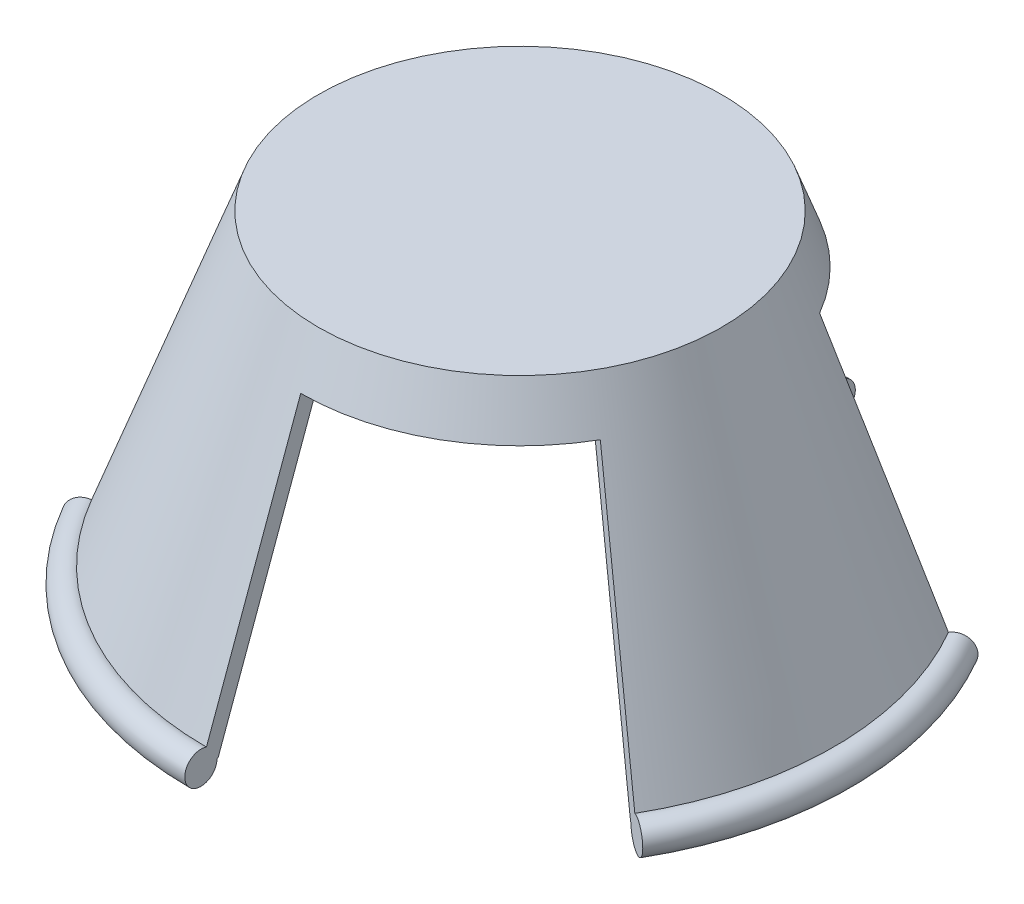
ISO-10303-21;
HEADER;
FILE_DESCRIPTION(('STEP AP214'),'2;1');
FILE_NAME('part.step','',(''),(''),'','','');
FILE_SCHEMA(('AUTOMOTIVE_DESIGN { 1 0 10303 214 1 1 1 1 }'));
ENDSEC;
DATA;
#1=APPLICATION_CONTEXT('core data for automotive mechanical design processes');
#2=APPLICATION_PROTOCOL_DEFINITION('international standard','automotive_design',2000,#1);
#3=PRODUCT_CONTEXT('',#1,'mechanical');
#4=PRODUCT('Part','Part','',(#3));
#5=PRODUCT_RELATED_PRODUCT_CATEGORY('part','',(#4));
#6=PRODUCT_DEFINITION_FORMATION('','',#4);
#7=PRODUCT_DEFINITION_CONTEXT('part definition',#1,'design');
#8=PRODUCT_DEFINITION('design','',#6,#7);
#9=PRODUCT_DEFINITION_SHAPE('','',#8);
#10=(LENGTH_UNIT() NAMED_UNIT(*) SI_UNIT(.MILLI.,.METRE.));
#11=(NAMED_UNIT(*) PLANE_ANGLE_UNIT() SI_UNIT($,.RADIAN.));
#12=(NAMED_UNIT(*) SI_UNIT($,.STERADIAN.) SOLID_ANGLE_UNIT());
#13=UNCERTAINTY_MEASURE_WITH_UNIT(LENGTH_MEASURE(1.E-05),#10,'distance_accuracy_value','');
#14=(GEOMETRIC_REPRESENTATION_CONTEXT(3) GLOBAL_UNCERTAINTY_ASSIGNED_CONTEXT((#13)) GLOBAL_UNIT_ASSIGNED_CONTEXT((#10,
#11,#12)) REPRESENTATION_CONTEXT('',''));
#15=CARTESIAN_POINT('',(0.,0.,0.));
#16=DIRECTION('',(0.,0.,1.));
#17=DIRECTION('',(1.,0.,0.));
#18=AXIS2_PLACEMENT_3D('',#15,#16,#17);
#19=CARTESIAN_POINT('',(0.,0.,0.));
#20=DIRECTION('',(0.,1.,0.));
#21=DIRECTION('',(0.,0.,1.));
#22=AXIS2_PLACEMENT_3D('',#19,#20,#21);
#23=TOROIDAL_SURFACE('',#22,19.7794046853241,1.);
#24=CARTESIAN_POINT('',(0.,0.,0.));
#25=DIRECTION('',(0.,1.,0.));
#26=DIRECTION('',(0.,0.,1.));
#27=AXIS2_PLACEMENT_3D('',#24,#25,#26);
#28=CIRCLE('',#27,18.7794046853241);
#29=CARTESIAN_POINT('',(0.,0.,-18.7794046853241));
#30=VERTEX_POINT('',#29);
#31=CARTESIAN_POINT('',(-16.2634415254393,0.,-9.38970234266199));
#32=VERTEX_POINT('',#31);
#33=EDGE_CURVE('E235',#30,#32,#28,.T.);
#34=ORIENTED_EDGE('',*,*,#33,.T.);
#35=CARTESIAN_POINT('',(-17.1294669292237,0.,-9.88970234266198));
#36=DIRECTION('',(0.499999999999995,0.,-0.866025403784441));
#37=DIRECTION('',(-0.866025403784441,0.,-0.499999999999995));
#38=AXIS2_PLACEMENT_3D('',#35,#36,#37);
#39=CIRCLE('',#38,1.);
#40=CARTESIAN_POINT('',(-16.8332687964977,0.939692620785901,-9.71869227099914));
#41=VERTEX_POINT('',#40);
#42=EDGE_CURVE('E189',#41,#32,#39,.F.);
#43=ORIENTED_EDGE('',*,*,#42,.F.);
#44=CARTESIAN_POINT('',(0.,0.939692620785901,0.));
#45=DIRECTION('',(0.,1.,0.));
#46=DIRECTION('',(0.,0.,1.));
#47=AXIS2_PLACEMENT_3D('',#44,#45,#46);
#48=CIRCLE('',#47,19.4373845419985);
#49=CARTESIAN_POINT('',(0.,0.939692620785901,-19.4373845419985));
#50=VERTEX_POINT('',#49);
#51=EDGE_CURVE('E240',#50,#41,#48,.T.);
#52=ORIENTED_EDGE('',*,*,#51,.F.);
#53=CARTESIAN_POINT('',(0.,0.,-19.7794046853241));
#54=DIRECTION('',(-1.,0.,0.));
#55=DIRECTION('',(0.,0.,1.));
#56=AXIS2_PLACEMENT_3D('',#53,#54,#55);
#57=CIRCLE('',#56,1.);
#58=EDGE_CURVE('E220',#30,#50,#57,.F.);
#59=ORIENTED_EDGE('',*,*,#58,.F.);
#60=EDGE_LOOP('',(#34,#43,#52,#59));
#61=FACE_BOUND('',#60,.T.);
#62=ADVANCED_FACE('F41',(#61),#23,.T.);
#63=CARTESIAN_POINT('',(-17.1294669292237,0.,9.88970234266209));
#64=DIRECTION('',(0.500000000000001,0.,0.866025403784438));
#65=DIRECTION('',(0.866025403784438,0.,-0.500000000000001));
#66=AXIS2_PLACEMENT_3D('',#63,#64,#65);
#67=CIRCLE('',#66,1.);
#68=CARTESIAN_POINT('',(-16.2634415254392,0.,9.38970234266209));
#69=VERTEX_POINT('',#68);
#70=CARTESIAN_POINT('',(-16.8332687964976,0.939692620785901,9.71869227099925));
#71=VERTEX_POINT('',#70);
#72=EDGE_CURVE('E196',#69,#71,#67,.F.);
#73=ORIENTED_EDGE('',*,*,#72,.F.);
#74=CARTESIAN_POINT('',(1.87643947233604E-13,0.,18.7794046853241));
#75=VERTEX_POINT('',#74);
#76=EDGE_CURVE('E239',#69,#75,#28,.T.);
#77=ORIENTED_EDGE('',*,*,#76,.T.);
#78=CARTESIAN_POINT('',(1.9763595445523E-13,0.,19.7794046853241));
#79=DIRECTION('',(-1.,0.,0.));
#80=DIRECTION('',(0.,0.,1.));
#81=AXIS2_PLACEMENT_3D('',#78,#79,#80);
#82=CIRCLE('',#81,1.);
#83=CARTESIAN_POINT('',(1.94218486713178E-13,0.939692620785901,19.4373845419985));
#84=VERTEX_POINT('',#83);
#85=EDGE_CURVE('E173',#84,#75,#82,.F.);
#86=ORIENTED_EDGE('',*,*,#85,.F.);
#87=EDGE_CURVE('E171',#71,#84,#48,.T.);
#88=ORIENTED_EDGE('',*,*,#87,.F.);
#89=EDGE_LOOP('',(#73,#77,#86,#88));
#90=FACE_BOUND('',#89,.T.);
#91=ADVANCED_FACE('F286',(#90),#23,.T.);
#92=CARTESIAN_POINT('',(0.,0.,0.));
#93=DIRECTION('',(0.,-1.,0.));
#94=DIRECTION('',(0.,0.,-1.));
#95=AXIS2_PLACEMENT_3D('',#92,#93,#94);
#96=PLANE('',#95);
#97=DIRECTION('',(-0.866025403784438,0.,0.500000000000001));
#98=VECTOR('',#97,1.);
#99=CARTESIAN_POINT('',(0.,0.,0.));
#100=LINE('',#99,#98);
#101=CARTESIAN_POINT('',(-16.2078619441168,0.,9.35761345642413));
#102=VERTEX_POINT('',#101);
#103=EDGE_CURVE('E193',#102,#69,#100,.T.);
#104=ORIENTED_EDGE('',*,*,#103,.F.);
#105=CARTESIAN_POINT('',(0.,0.,0.));
#106=DIRECTION('',(0.,-1.,0.));
#107=DIRECTION('',(0.,0.,-1.));
#108=AXIS2_PLACEMENT_3D('',#105,#106,#107);
#109=CIRCLE('',#108,18.7152269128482);
#110=CARTESIAN_POINT('',(1.87002682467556E-13,0.,18.7152269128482));
#111=VERTEX_POINT('',#110);
#112=EDGE_CURVE('E234',#102,#111,#109,.F.);
#113=ORIENTED_EDGE('',*,*,#112,.T.);
#114=DIRECTION('',(0.,0.,-1.));
#115=VECTOR('',#114,1.);
#116=CARTESIAN_POINT('',(0.,0.,0.));
#117=LINE('',#116,#115);
#118=EDGE_CURVE('E155',#75,#111,#117,.T.);
#119=ORIENTED_EDGE('',*,*,#118,.F.);
#120=ORIENTED_EDGE('',*,*,#76,.F.);
#121=EDGE_LOOP('',(#104,#113,#119,#120));
#122=FACE_BOUND('',#121,.T.);
#123=ADVANCED_FACE('F290',(#122),#96,.T.);
#124=DIRECTION('',(0.866025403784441,0.,0.499999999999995));
#125=VECTOR('',#124,1.);
#126=CARTESIAN_POINT('',(0.,0.,0.));
#127=LINE('',#126,#125);
#128=CARTESIAN_POINT('',(16.2078619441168,0.,9.35761345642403));
#129=VERTEX_POINT('',#128);
#130=CARTESIAN_POINT('',(16.2634415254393,0.,9.38970234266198));
#131=VERTEX_POINT('',#130);
#132=EDGE_CURVE('E172',#129,#131,#127,.T.);
#133=ORIENTED_EDGE('',*,*,#132,.F.);
#134=CARTESIAN_POINT('',(16.2078619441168,0.,-9.35761345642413));
#135=VERTEX_POINT('',#134);
#136=EDGE_CURVE('E224',#129,#135,#109,.F.);
#137=ORIENTED_EDGE('',*,*,#136,.T.);
#138=DIRECTION('',(-0.866025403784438,0.,0.500000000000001));
#139=VECTOR('',#138,1.);
#140=CARTESIAN_POINT('',(0.,0.,0.));
#141=LINE('',#140,#139);
#142=CARTESIAN_POINT('',(16.2634415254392,0.,-9.38970234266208));
#143=VERTEX_POINT('',#142);
#144=EDGE_CURVE('E208',#143,#135,#141,.T.);
#145=ORIENTED_EDGE('',*,*,#144,.F.);
#146=EDGE_CURVE('E228',#131,#143,#28,.T.);
#147=ORIENTED_EDGE('',*,*,#146,.F.);
#148=EDGE_LOOP('',(#133,#137,#145,#147));
#149=FACE_BOUND('',#148,.T.);
#150=ADVANCED_FACE('F304',(#149),#96,.T.);
#151=CARTESIAN_POINT('',(0.,19.6579798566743,0.));
#152=DIRECTION('',(0.,-1.,0.));
#153=DIRECTION('',(0.,0.,-1.));
#154=AXIS2_PLACEMENT_3D('',#151,#152,#153);
#155=CONICAL_SURFACE('',#154,11.5603073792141,0.34906585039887);
#156=ORIENTED_EDGE('',*,*,#112,.F.);
#157=DIRECTION('',(-0.296198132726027,-0.939692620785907,0.171010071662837));
#158=VECTOR('',#157,1.);
#159=CARTESIAN_POINT('',(0.,51.4196633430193,0.));
#160=LINE('',#159,#158);
#161=CARTESIAN_POINT('',(-10.8493349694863,17.,6.26386646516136));
#162=VERTEX_POINT('',#161);
#163=EDGE_CURVE('E11',#102,#162,#160,.F.);
#164=ORIENTED_EDGE('',*,*,#163,.T.);
#165=CARTESIAN_POINT('',(0.,17.,0.));
#166=DIRECTION('',(0.,1.,0.));
#167=DIRECTION('',(0.,0.,1.));
#168=AXIS2_PLACEMENT_3D('',#165,#166,#167);
#169=CIRCLE('',#168,12.5277329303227);
#170=CARTESIAN_POINT('',(1.25177197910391E-13,17.,12.5277329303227));
#171=VERTEX_POINT('',#170);
#172=EDGE_CURVE('E229',#162,#171,#169,.T.);
#173=ORIENTED_EDGE('',*,*,#172,.T.);
#174=DIRECTION('',(0.,0.939692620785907,-0.342020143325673));
#175=VECTOR('',#174,1.);
#176=CARTESIAN_POINT('',(0.,51.4196633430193,0.));
#177=LINE('',#176,#175);
#178=EDGE_CURVE('E162',#171,#111,#177,.F.);
#179=ORIENTED_EDGE('',*,*,#178,.T.);
#180=EDGE_LOOP('',(#156,#164,#173,#179));
#181=FACE_BOUND('',#180,.T.);
#182=ADVANCED_FACE('F300',(#181),#155,.F.);
#183=ORIENTED_EDGE('',*,*,#136,.F.);
#184=DIRECTION('',(0.296198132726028,-0.939692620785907,0.171010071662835));
#185=VECTOR('',#184,1.);
#186=CARTESIAN_POINT('',(0.,51.4196633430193,0.));
#187=LINE('',#186,#185);
#188=CARTESIAN_POINT('',(10.8493349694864,17.,6.26386646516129));
#189=VERTEX_POINT('',#188);
#190=EDGE_CURVE('E253',#129,#189,#187,.F.);
#191=ORIENTED_EDGE('',*,*,#190,.T.);
#192=CARTESIAN_POINT('',(10.8493349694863,17.,-6.26386646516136));
#193=VERTEX_POINT('',#192);
#194=EDGE_CURVE('E230',#189,#193,#169,.T.);
#195=ORIENTED_EDGE('',*,*,#194,.T.);
#196=DIRECTION('',(-0.296198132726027,0.939692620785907,0.171010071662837));
#197=VECTOR('',#196,1.);
#198=CARTESIAN_POINT('',(0.,51.4196633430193,0.));
#199=LINE('',#198,#197);
#200=EDGE_CURVE('E246',#193,#135,#199,.F.);
#201=ORIENTED_EDGE('',*,*,#200,.T.);
#202=EDGE_LOOP('',(#183,#191,#195,#201));
#203=FACE_BOUND('',#202,.T.);
#204=ADVANCED_FACE('F303',(#203),#155,.F.);
#205=CARTESIAN_POINT('',(-12.5,20.,0.));
#206=DIRECTION('',(0.,1.,0.));
#207=DIRECTION('',(0.,0.,1.));
#208=AXIS2_PLACEMENT_3D('',#205,#206,#207);
#209=PLANE('',#208);
#210=CARTESIAN_POINT('',(0.,20.,0.));
#211=DIRECTION('',(0.,1.,0.));
#212=DIRECTION('',(0.,0.,1.));
#213=AXIS2_PLACEMENT_3D('',#210,#211,#212);
#214=CIRCLE('',#213,12.5);
#215=CARTESIAN_POINT('',(0.,20.,12.5));
#216=VERTEX_POINT('',#215);
#217=EDGE_CURVE('E243',#216,#216,#214,.T.);
#218=ORIENTED_EDGE('',*,*,#217,.T.);
#219=EDGE_LOOP('',(#218));
#220=FACE_BOUND('',#219,.T.);
#221=ADVANCED_FACE('F43',(#220),#209,.T.);
#222=CARTESIAN_POINT('',(0.,20.,0.));
#223=DIRECTION('',(0.,-1.,0.));
#224=DIRECTION('',(0.,0.,-1.));
#225=AXIS2_PLACEMENT_3D('',#222,#223,#224);
#226=CONICAL_SURFACE('',#225,12.5,0.34906585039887);
#227=DIRECTION('',(-0.296198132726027,-0.939692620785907,0.171010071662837));
#228=VECTOR('',#227,1.);
#229=CARTESIAN_POINT('',(0.,54.3434677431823,0.));
#230=LINE('',#229,#228);
#231=CARTESIAN_POINT('',(-11.7709399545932,17.,6.79595535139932));
#232=VERTEX_POINT('',#231);
#233=EDGE_CURVE('E198',#71,#232,#230,.F.);
#234=ORIENTED_EDGE('',*,*,#233,.F.);
#235=ORIENTED_EDGE('',*,*,#87,.T.);
#236=DIRECTION('',(0.,0.939692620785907,-0.342020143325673));
#237=VECTOR('',#236,1.);
#238=CARTESIAN_POINT('',(0.,54.3434677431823,0.));
#239=LINE('',#238,#237);
#240=CARTESIAN_POINT('',(1.35810469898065E-13,17.,13.5919107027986));
#241=VERTEX_POINT('',#240);
#242=EDGE_CURVE('E159',#241,#84,#239,.F.);
#243=ORIENTED_EDGE('',*,*,#242,.F.);
#244=CARTESIAN_POINT('',(0.,17.,0.));
#245=DIRECTION('',(0.,-1.,0.));
#246=DIRECTION('',(0.,0.,-1.));
#247=AXIS2_PLACEMENT_3D('',#244,#245,#246);
#248=CIRCLE('',#247,13.5919107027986);
#249=CARTESIAN_POINT('',(11.7709399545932,17.,6.79595535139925));
#250=VERTEX_POINT('',#249);
#251=EDGE_CURVE('E148',#241,#250,#248,.F.);
#252=ORIENTED_EDGE('',*,*,#251,.T.);
#253=DIRECTION('',(0.296198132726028,-0.939692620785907,0.171010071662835));
#254=VECTOR('',#253,1.);
#255=CARTESIAN_POINT('',(0.,54.3434677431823,0.));
#256=LINE('',#255,#254);
#257=CARTESIAN_POINT('',(16.8332687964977,0.939692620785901,9.71869227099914));
#258=VERTEX_POINT('',#257);
#259=EDGE_CURVE('E182',#258,#250,#256,.F.);
#260=ORIENTED_EDGE('',*,*,#259,.F.);
#261=CARTESIAN_POINT('',(16.8332687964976,0.939692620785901,-9.71869227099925));
#262=VERTEX_POINT('',#261);
#263=EDGE_CURVE('E238',#258,#262,#48,.T.);
#264=ORIENTED_EDGE('',*,*,#263,.T.);
#265=DIRECTION('',(-0.296198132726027,0.939692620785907,0.171010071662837));
#266=VECTOR('',#265,1.);
#267=CARTESIAN_POINT('',(0.,54.3434677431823,0.));
#268=LINE('',#267,#266);
#269=CARTESIAN_POINT('',(11.7709399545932,17.,-6.79595535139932));
#270=VERTEX_POINT('',#269);
#271=EDGE_CURVE('E214',#270,#262,#268,.F.);
#272=ORIENTED_EDGE('',*,*,#271,.F.);
#273=CARTESIAN_POINT('',(0.,17.,0.));
#274=DIRECTION('',(0.,-1.,0.));
#275=DIRECTION('',(0.,0.,-1.));
#276=AXIS2_PLACEMENT_3D('',#273,#274,#275);
#277=CIRCLE('',#276,13.5919107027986);
#278=CARTESIAN_POINT('',(0.,17.,-13.5919107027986));
#279=VERTEX_POINT('',#278);
#280=EDGE_CURVE('E205',#270,#279,#277,.F.);
#281=ORIENTED_EDGE('',*,*,#280,.T.);
#282=DIRECTION('',(0.,-0.939692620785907,-0.342020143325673));
#283=VECTOR('',#282,1.);
#284=CARTESIAN_POINT('',(0.,54.3434677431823,0.));
#285=LINE('',#284,#283);
#286=EDGE_CURVE('E222',#50,#279,#285,.F.);
#287=ORIENTED_EDGE('',*,*,#286,.F.);
#288=ORIENTED_EDGE('',*,*,#51,.T.);
#289=DIRECTION('',(0.296198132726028,0.939692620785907,0.171010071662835));
#290=VECTOR('',#289,1.);
#291=CARTESIAN_POINT('',(0.,54.3434677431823,0.));
#292=LINE('',#291,#290);
#293=CARTESIAN_POINT('',(-11.7709399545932,17.,-6.79595535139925));
#294=VERTEX_POINT('',#293);
#295=EDGE_CURVE('E191',#294,#41,#292,.F.);
#296=ORIENTED_EDGE('',*,*,#295,.F.);
#297=CARTESIAN_POINT('',(0.,17.,0.));
#298=DIRECTION('',(0.,-1.,0.));
#299=DIRECTION('',(0.,0.,-1.));
#300=AXIS2_PLACEMENT_3D('',#297,#298,#299);
#301=CIRCLE('',#300,13.5919107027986);
#302=EDGE_CURVE('E184',#294,#232,#301,.F.);
#303=ORIENTED_EDGE('',*,*,#302,.T.);
#304=EDGE_LOOP('',(#234,#235,#243,#252,#260,#264,#272,#281,#287,#288,#296,#303));
#305=FACE_BOUND('',#304,.T.);
#306=ORIENTED_EDGE('',*,*,#217,.F.);
#307=EDGE_LOOP('',(#306));
#308=FACE_BOUND('',#307,.T.);
#309=ADVANCED_FACE('F168',(#305,#308),#226,.T.);
#310=CARTESIAN_POINT('',(17.1294669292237,0.,9.88970234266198));
#311=DIRECTION('',(0.499999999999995,0.,-0.866025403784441));
#312=DIRECTION('',(-0.866025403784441,0.,-0.499999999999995));
#313=AXIS2_PLACEMENT_3D('',#310,#311,#312);
#314=CIRCLE('',#313,1.);
#315=EDGE_CURVE('E176',#131,#258,#314,.F.);
#316=ORIENTED_EDGE('',*,*,#315,.F.);
#317=ORIENTED_EDGE('',*,*,#146,.T.);
#318=CARTESIAN_POINT('',(17.1294669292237,0.,-9.88970234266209));
#319=DIRECTION('',(0.500000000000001,0.,0.866025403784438));
#320=DIRECTION('',(0.866025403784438,0.,-0.500000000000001));
#321=AXIS2_PLACEMENT_3D('',#318,#319,#320);
#322=CIRCLE('',#321,1.);
#323=EDGE_CURVE('E211',#262,#143,#322,.F.);
#324=ORIENTED_EDGE('',*,*,#323,.F.);
#325=ORIENTED_EDGE('',*,*,#263,.F.);
#326=EDGE_LOOP('',(#316,#317,#324,#325));
#327=FACE_BOUND('',#326,.T.);
#328=ADVANCED_FACE('F279',(#327),#23,.T.);
#329=DIRECTION('',(0.866025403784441,0.,0.499999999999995));
#330=VECTOR('',#329,1.);
#331=CARTESIAN_POINT('',(0.,0.,0.));
#332=LINE('',#331,#330);
#333=CARTESIAN_POINT('',(-16.2078619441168,0.,-9.35761345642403));
#334=VERTEX_POINT('',#333);
#335=EDGE_CURVE('E187',#32,#334,#332,.T.);
#336=ORIENTED_EDGE('',*,*,#335,.F.);
#337=ORIENTED_EDGE('',*,*,#33,.F.);
#338=DIRECTION('',(0.,0.,-1.));
#339=VECTOR('',#338,1.);
#340=CARTESIAN_POINT('',(0.,0.,0.));
#341=LINE('',#340,#339);
#342=CARTESIAN_POINT('',(0.,0.,-18.7152269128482));
#343=VERTEX_POINT('',#342);
#344=EDGE_CURVE('E217',#343,#30,#341,.T.);
#345=ORIENTED_EDGE('',*,*,#344,.F.);
#346=EDGE_CURVE('E231',#343,#334,#109,.F.);
#347=ORIENTED_EDGE('',*,*,#346,.T.);
#348=EDGE_LOOP('',(#336,#337,#345,#347));
#349=FACE_BOUND('',#348,.T.);
#350=ADVANCED_FACE('F263',(#349),#96,.T.);
#351=CARTESIAN_POINT('',(-12.5,17.,0.));
#352=DIRECTION('',(0.,1.,0.));
#353=DIRECTION('',(0.,0.,1.));
#354=AXIS2_PLACEMENT_3D('',#351,#352,#353);
#355=PLANE('',#354);
#356=ORIENTED_EDGE('',*,*,#172,.F.);
#357=DIRECTION('',(0.866025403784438,0.,-0.500000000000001));
#358=VECTOR('',#357,1.);
#359=CARTESIAN_POINT('',(0.,17.,0.));
#360=LINE('',#359,#358);
#361=EDGE_CURVE('E164',#232,#162,#360,.T.);
#362=ORIENTED_EDGE('',*,*,#361,.F.);
#363=ORIENTED_EDGE('',*,*,#302,.F.);
#364=DIRECTION('',(-0.866025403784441,0.,-0.499999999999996));
#365=VECTOR('',#364,1.);
#366=CARTESIAN_POINT('',(0.,17.,0.));
#367=LINE('',#366,#365);
#368=CARTESIAN_POINT('',(-10.8493349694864,17.,-6.2638664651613));
#369=VERTEX_POINT('',#368);
#370=EDGE_CURVE('E63',#369,#294,#367,.T.);
#371=ORIENTED_EDGE('',*,*,#370,.F.);
#372=CARTESIAN_POINT('',(0.,17.,-12.5277329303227));
#373=VERTEX_POINT('',#372);
#374=EDGE_CURVE('E225',#373,#369,#169,.T.);
#375=ORIENTED_EDGE('',*,*,#374,.F.);
#376=DIRECTION('',(0.,0.,1.));
#377=VECTOR('',#376,1.);
#378=CARTESIAN_POINT('',(0.,17.,0.));
#379=LINE('',#378,#377);
#380=EDGE_CURVE('E200',#279,#373,#379,.T.);
#381=ORIENTED_EDGE('',*,*,#380,.F.);
#382=ORIENTED_EDGE('',*,*,#280,.F.);
#383=DIRECTION('',(0.866025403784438,0.,-0.500000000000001));
#384=VECTOR('',#383,1.);
#385=CARTESIAN_POINT('',(0.,17.,0.));
#386=LINE('',#385,#384);
#387=EDGE_CURVE('E202',#193,#270,#386,.T.);
#388=ORIENTED_EDGE('',*,*,#387,.F.);
#389=ORIENTED_EDGE('',*,*,#194,.F.);
#390=DIRECTION('',(-0.866025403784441,0.,-0.499999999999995));
#391=VECTOR('',#390,1.);
#392=CARTESIAN_POINT('',(0.,17.,0.));
#393=LINE('',#392,#391);
#394=EDGE_CURVE('E151',#250,#189,#393,.T.);
#395=ORIENTED_EDGE('',*,*,#394,.F.);
#396=ORIENTED_EDGE('',*,*,#251,.F.);
#397=DIRECTION('',(0.,0.,1.));
#398=VECTOR('',#397,1.);
#399=CARTESIAN_POINT('',(0.,17.,0.));
#400=LINE('',#399,#398);
#401=EDGE_CURVE('E56',#171,#241,#400,.T.);
#402=ORIENTED_EDGE('',*,*,#401,.F.);
#403=EDGE_LOOP('',(#356,#362,#363,#371,#375,#381,#382,#388,#389,#395,#396,#402));
#404=FACE_BOUND('',#403,.T.);
#405=ADVANCED_FACE('F149',(#404),#355,.F.);
#406=ORIENTED_EDGE('',*,*,#374,.T.);
#407=DIRECTION('',(0.296198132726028,0.939692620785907,0.171010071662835));
#408=VECTOR('',#407,1.);
#409=CARTESIAN_POINT('',(0.,51.4196633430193,0.));
#410=LINE('',#409,#408);
#411=EDGE_CURVE('E49',#369,#334,#410,.F.);
#412=ORIENTED_EDGE('',*,*,#411,.T.);
#413=ORIENTED_EDGE('',*,*,#346,.F.);
#414=DIRECTION('',(0.,-0.939692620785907,-0.342020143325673));
#415=VECTOR('',#414,1.);
#416=CARTESIAN_POINT('',(0.,51.4196633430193,0.));
#417=LINE('',#416,#415);
#418=EDGE_CURVE('E249',#343,#373,#417,.F.);
#419=ORIENTED_EDGE('',*,*,#418,.T.);
#420=EDGE_LOOP('',(#406,#412,#413,#419));
#421=FACE_BOUND('',#420,.T.);
#422=ADVANCED_FACE('F258',(#421),#155,.F.);
#423=CARTESIAN_POINT('',(0.,-1.,0.));
#424=DIRECTION('',(-1.,0.,0.));
#425=DIRECTION('',(0.,0.,1.));
#426=AXIS2_PLACEMENT_3D('',#423,#424,#425);
#427=PLANE('',#426);
#428=ORIENTED_EDGE('',*,*,#286,.T.);
#429=ORIENTED_EDGE('',*,*,#380,.T.);
#430=ORIENTED_EDGE('',*,*,#418,.F.);
#431=ORIENTED_EDGE('',*,*,#344,.T.);
#432=ORIENTED_EDGE('',*,*,#58,.T.);
#433=EDGE_LOOP('',(#428,#429,#430,#431,#432));
#434=FACE_BOUND('',#433,.T.);
#435=ADVANCED_FACE('F266',(#434),#427,.F.);
#436=CARTESIAN_POINT('',(0.,-1.,0.));
#437=DIRECTION('',(0.500000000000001,0.,0.866025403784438));
#438=DIRECTION('',(0.866025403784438,0.,-0.500000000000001));
#439=AXIS2_PLACEMENT_3D('',#436,#437,#438);
#440=PLANE('',#439);
#441=ORIENTED_EDGE('',*,*,#271,.T.);
#442=ORIENTED_EDGE('',*,*,#323,.T.);
#443=ORIENTED_EDGE('',*,*,#144,.T.);
#444=ORIENTED_EDGE('',*,*,#200,.F.);
#445=ORIENTED_EDGE('',*,*,#387,.T.);
#446=EDGE_LOOP('',(#441,#442,#443,#444,#445));
#447=FACE_BOUND('',#446,.T.);
#448=ADVANCED_FACE('F275',(#447),#440,.F.);
#449=CARTESIAN_POINT('',(0.,-1.,0.));
#450=DIRECTION('',(0.499999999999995,0.,-0.866025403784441));
#451=DIRECTION('',(-0.866025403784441,0.,-0.499999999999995));
#452=AXIS2_PLACEMENT_3D('',#449,#450,#451);
#453=PLANE('',#452);
#454=ORIENTED_EDGE('',*,*,#259,.T.);
#455=ORIENTED_EDGE('',*,*,#394,.T.);
#456=ORIENTED_EDGE('',*,*,#190,.F.);
#457=ORIENTED_EDGE('',*,*,#132,.T.);
#458=ORIENTED_EDGE('',*,*,#315,.T.);
#459=EDGE_LOOP('',(#454,#455,#456,#457,#458));
#460=FACE_BOUND('',#459,.T.);
#461=ADVANCED_FACE('F306',(#460),#453,.F.);
#462=CARTESIAN_POINT('',(0.,-1.,0.));
#463=DIRECTION('',(-1.,0.,0.));
#464=DIRECTION('',(0.,0.,1.));
#465=AXIS2_PLACEMENT_3D('',#462,#463,#464);
#466=PLANE('',#465);
#467=ORIENTED_EDGE('',*,*,#242,.T.);
#468=ORIENTED_EDGE('',*,*,#85,.T.);
#469=ORIENTED_EDGE('',*,*,#118,.T.);
#470=ORIENTED_EDGE('',*,*,#178,.F.);
#471=ORIENTED_EDGE('',*,*,#401,.T.);
#472=EDGE_LOOP('',(#467,#468,#469,#470,#471));
#473=FACE_BOUND('',#472,.T.);
#474=ADVANCED_FACE('F158',(#473),#466,.F.);
#475=CARTESIAN_POINT('',(0.,-1.,0.));
#476=DIRECTION('',(0.500000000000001,0.,0.866025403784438));
#477=DIRECTION('',(0.866025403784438,0.,-0.500000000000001));
#478=AXIS2_PLACEMENT_3D('',#475,#476,#477);
#479=PLANE('',#478);
#480=ORIENTED_EDGE('',*,*,#233,.T.);
#481=ORIENTED_EDGE('',*,*,#361,.T.);
#482=ORIENTED_EDGE('',*,*,#163,.F.);
#483=ORIENTED_EDGE('',*,*,#103,.T.);
#484=ORIENTED_EDGE('',*,*,#72,.T.);
#485=EDGE_LOOP('',(#480,#481,#482,#483,#484));
#486=FACE_BOUND('',#485,.T.);
#487=ADVANCED_FACE('F298',(#486),#479,.F.);
#488=CARTESIAN_POINT('',(0.,-1.,0.));
#489=DIRECTION('',(0.499999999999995,0.,-0.866025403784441));
#490=DIRECTION('',(-0.866025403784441,0.,-0.499999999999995));
#491=AXIS2_PLACEMENT_3D('',#488,#489,#490);
#492=PLANE('',#491);
#493=ORIENTED_EDGE('',*,*,#295,.T.);
#494=ORIENTED_EDGE('',*,*,#42,.T.);
#495=ORIENTED_EDGE('',*,*,#335,.T.);
#496=ORIENTED_EDGE('',*,*,#411,.F.);
#497=ORIENTED_EDGE('',*,*,#370,.T.);
#498=EDGE_LOOP('',(#493,#494,#495,#496,#497));
#499=FACE_BOUND('',#498,.T.);
#500=ADVANCED_FACE('F378',(#499),#492,.F.);
#501=CLOSED_SHELL('',(#62,#91,#123,#150,#182,#204,#221,#309,#328,#350,#405,#422,#435,#448,#461,
#474,#487,#500));
#502=MANIFOLD_SOLID_BREP('B2',#501);
#503=ADVANCED_BREP_SHAPE_REPRESENTATION('',(#18,#502),#14);
#504=SHAPE_DEFINITION_REPRESENTATION(#9,#503);
ENDSEC;
END-ISO-10303-21;
